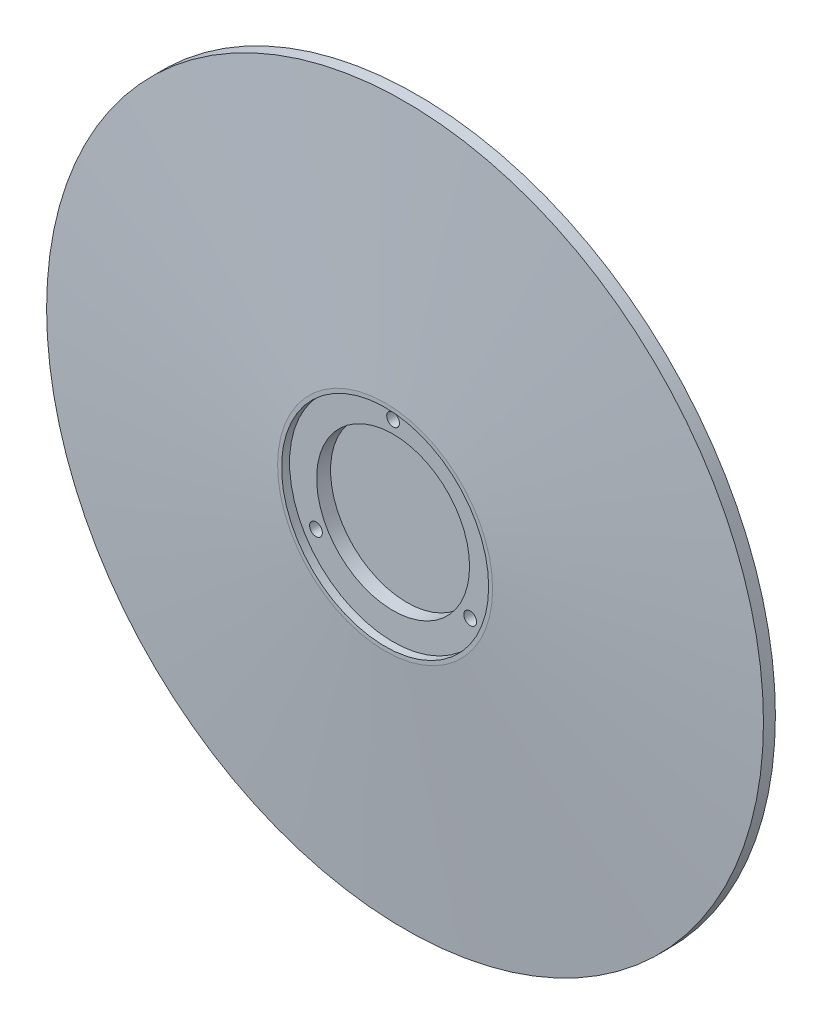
ISO-10303-21;
HEADER;
FILE_DESCRIPTION(('STEP AP214'),'2;1');
FILE_NAME('part.step','',(''),(''),'','','');
FILE_SCHEMA(('AUTOMOTIVE_DESIGN { 1 0 10303 214 1 1 1 1 }'));
ENDSEC;
DATA;
#1=APPLICATION_CONTEXT('core data for automotive mechanical design processes');
#2=APPLICATION_PROTOCOL_DEFINITION('international standard','automotive_design',2000,#1);
#3=PRODUCT_CONTEXT('',#1,'mechanical');
#4=PRODUCT('Part','Part','',(#3));
#5=PRODUCT_RELATED_PRODUCT_CATEGORY('part','',(#4));
#6=PRODUCT_DEFINITION_FORMATION('','',#4);
#7=PRODUCT_DEFINITION_CONTEXT('part definition',#1,'design');
#8=PRODUCT_DEFINITION('design','',#6,#7);
#9=PRODUCT_DEFINITION_SHAPE('','',#8);
#10=(LENGTH_UNIT() NAMED_UNIT(*) SI_UNIT(.MILLI.,.METRE.));
#11=(NAMED_UNIT(*) PLANE_ANGLE_UNIT() SI_UNIT($,.RADIAN.));
#12=(NAMED_UNIT(*) SI_UNIT($,.STERADIAN.) SOLID_ANGLE_UNIT());
#13=UNCERTAINTY_MEASURE_WITH_UNIT(LENGTH_MEASURE(1.E-05),#10,'distance_accuracy_value','');
#14=(GEOMETRIC_REPRESENTATION_CONTEXT(3) GLOBAL_UNCERTAINTY_ASSIGNED_CONTEXT((#13)) GLOBAL_UNIT_ASSIGNED_CONTEXT((#10,
#11,#12)) REPRESENTATION_CONTEXT('',''));
#15=CARTESIAN_POINT('',(0.,0.,0.));
#16=DIRECTION('',(0.,0.,1.));
#17=DIRECTION('',(1.,0.,0.));
#18=AXIS2_PLACEMENT_3D('',#15,#16,#17);
#19=CARTESIAN_POINT('',(0.,0.,0.));
#20=DIRECTION('',(0.,0.,-1.));
#21=DIRECTION('',(-1.,0.,0.));
#22=AXIS2_PLACEMENT_3D('',#19,#20,#21);
#23=PLANE('',#22);
#24=CARTESIAN_POINT('',(0.,0.,0.));
#25=DIRECTION('',(0.,0.,-1.));
#26=DIRECTION('',(-1.,0.,0.));
#27=AXIS2_PLACEMENT_3D('',#24,#25,#26);
#28=CIRCLE('',#27,90.);
#29=CARTESIAN_POINT('',(-90.,0.,0.));
#30=VERTEX_POINT('',#29);
#31=EDGE_CURVE('E10',#30,#30,#28,.T.);
#32=ORIENTED_EDGE('',*,*,#31,.T.);
#33=EDGE_LOOP('',(#32));
#34=FACE_BOUND('',#33,.T.);
#35=ADVANCED_FACE('F32',(#34),#23,.T.);
#36=CARTESIAN_POINT('',(0.,0.,-33.3508541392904));
#37=DIRECTION('',(0.,0.,-1.));
#38=DIRECTION('',(-1.,0.,0.));
#39=AXIS2_PLACEMENT_3D('',#36,#37,#38);
#40=CYLINDRICAL_SURFACE('',#39,90.);
#41=CARTESIAN_POINT('',(0.,0.,3.));
#42=DIRECTION('',(0.,0.,-1.));
#43=DIRECTION('',(-1.,0.,0.));
#44=AXIS2_PLACEMENT_3D('',#41,#42,#43);
#45=CIRCLE('',#44,90.);
#46=CARTESIAN_POINT('',(-90.,0.,3.));
#47=VERTEX_POINT('',#46);
#48=EDGE_CURVE('E38',#47,#47,#45,.T.);
#49=ORIENTED_EDGE('',*,*,#48,.T.);
#50=EDGE_LOOP('',(#49));
#51=FACE_BOUND('',#50,.T.);
#52=ORIENTED_EDGE('',*,*,#31,.F.);
#53=EDGE_LOOP('',(#52));
#54=FACE_BOUND('',#53,.T.);
#55=ADVANCED_FACE('F116',(#51,#54),#40,.T.);
#56=CARTESIAN_POINT('',(0.,0.,3.));
#57=DIRECTION('',(0.,0.,-1.));
#58=DIRECTION('',(-1.,0.,0.));
#59=AXIS2_PLACEMENT_3D('',#56,#57,#58);
#60=CONICAL_SURFACE('',#59,90.,1.49159725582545);
#61=CARTESIAN_POINT('',(0.,0.,8.));
#62=DIRECTION('',(0.,0.,-1.));
#63=DIRECTION('',(-1.,0.,0.));
#64=AXIS2_PLACEMENT_3D('',#61,#62,#63);
#65=CIRCLE('',#64,27.);
#66=CARTESIAN_POINT('',(-27.,0.,8.));
#67=VERTEX_POINT('',#66);
#68=EDGE_CURVE('E42',#67,#67,#65,.T.);
#69=CARTESIAN_POINT('',(-27.,0.,8.));
#70=CARTESIAN_POINT('',(-27.65625,0.,7.94791666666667));
#71=CARTESIAN_POINT('',(-28.3125,0.,7.89583333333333));
#72=CARTESIAN_POINT('',(-29.625,0.,7.79166666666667));
#73=CARTESIAN_POINT('',(-30.28125,0.,7.73958333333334));
#74=CARTESIAN_POINT('',(-31.59375,0.,7.63541666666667));
#75=CARTESIAN_POINT('',(-32.25,0.,7.58333333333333));
#76=CARTESIAN_POINT('',(-33.5625,0.,7.47916666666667));
#77=CARTESIAN_POINT('',(-34.21875,0.,7.42708333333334));
#78=CARTESIAN_POINT('',(-35.53125,0.,7.32291666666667));
#79=CARTESIAN_POINT('',(-36.1875,0.,7.27083333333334));
#80=CARTESIAN_POINT('',(-37.5,0.,7.16666666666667));
#81=CARTESIAN_POINT('',(-38.15625,0.,7.11458333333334));
#82=CARTESIAN_POINT('',(-39.46875,0.,7.01041666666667));
#83=CARTESIAN_POINT('',(-40.125,0.,6.95833333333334));
#84=CARTESIAN_POINT('',(-41.4375,0.,6.85416666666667));
#85=CARTESIAN_POINT('',(-42.09375,0.,6.80208333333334));
#86=CARTESIAN_POINT('',(-43.40625,0.,6.69791666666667));
#87=CARTESIAN_POINT('',(-44.0625,0.,6.64583333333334));
#88=CARTESIAN_POINT('',(-45.375,0.,6.54166666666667));
#89=CARTESIAN_POINT('',(-46.03125,0.,6.48958333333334));
#90=CARTESIAN_POINT('',(-47.34375,0.,6.38541666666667));
#91=CARTESIAN_POINT('',(-48.,0.,6.33333333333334));
#92=CARTESIAN_POINT('',(-49.3125,0.,6.22916666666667));
#93=CARTESIAN_POINT('',(-49.96875,0.,6.17708333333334));
#94=CARTESIAN_POINT('',(-51.28125,0.,6.07291666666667));
#95=CARTESIAN_POINT('',(-51.9375,0.,6.02083333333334));
#96=CARTESIAN_POINT('',(-53.25,0.,5.91666666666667));
#97=CARTESIAN_POINT('',(-53.90625,0.,5.86458333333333));
#98=CARTESIAN_POINT('',(-55.21875,0.,5.76041666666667));
#99=CARTESIAN_POINT('',(-55.875,0.,5.70833333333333));
#100=CARTESIAN_POINT('',(-57.1875,0.,5.60416666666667));
#101=CARTESIAN_POINT('',(-57.84375,0.,5.55208333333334));
#102=CARTESIAN_POINT('',(-59.15625,0.,5.44791666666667));
#103=CARTESIAN_POINT('',(-59.8125,0.,5.39583333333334));
#104=CARTESIAN_POINT('',(-61.125,0.,5.29166666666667));
#105=CARTESIAN_POINT('',(-61.78125,0.,5.23958333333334));
#106=CARTESIAN_POINT('',(-63.09375,0.,5.13541666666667));
#107=CARTESIAN_POINT('',(-63.75,0.,5.08333333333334));
#108=CARTESIAN_POINT('',(-65.0625,0.,4.97916666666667));
#109=CARTESIAN_POINT('',(-65.71875,0.,4.92708333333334));
#110=CARTESIAN_POINT('',(-67.03125,0.,4.82291666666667));
#111=CARTESIAN_POINT('',(-67.6875,0.,4.77083333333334));
#112=CARTESIAN_POINT('',(-69.,0.,4.66666666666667));
#113=CARTESIAN_POINT('',(-69.65625,0.,4.61458333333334));
#114=CARTESIAN_POINT('',(-70.96875,0.,4.51041666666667));
#115=CARTESIAN_POINT('',(-71.625,0.,4.45833333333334));
#116=CARTESIAN_POINT('',(-72.9375,0.,4.35416666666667));
#117=CARTESIAN_POINT('',(-73.59375,0.,4.30208333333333));
#118=CARTESIAN_POINT('',(-74.90625,0.,4.19791666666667));
#119=CARTESIAN_POINT('',(-75.5625,0.,4.14583333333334));
#120=CARTESIAN_POINT('',(-76.875,0.,4.04166666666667));
#121=CARTESIAN_POINT('',(-77.53125,0.,3.98958333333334));
#122=CARTESIAN_POINT('',(-78.84375,0.,3.88541666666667));
#123=CARTESIAN_POINT('',(-79.5,0.,3.83333333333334));
#124=CARTESIAN_POINT('',(-80.8125,0.,3.72916666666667));
#125=CARTESIAN_POINT('',(-81.46875,0.,3.67708333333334));
#126=CARTESIAN_POINT('',(-82.78125,0.,3.57291666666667));
#127=CARTESIAN_POINT('',(-83.4375,0.,3.52083333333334));
#128=CARTESIAN_POINT('',(-84.75,0.,3.41666666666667));
#129=CARTESIAN_POINT('',(-85.40625,0.,3.36458333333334));
#130=CARTESIAN_POINT('',(-86.71875,0.,3.26041666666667));
#131=CARTESIAN_POINT('',(-87.375,0.,3.20833333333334));
#132=CARTESIAN_POINT('',(-88.6875,0.,3.10416666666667));
#133=CARTESIAN_POINT('',(-89.34375,0.,3.05208333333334));
#134=CARTESIAN_POINT('',(-90.,0.,3.));
#135=B_SPLINE_CURVE_WITH_KNOTS('',3,(#69,#70,#71,#72,#73,#74,#75,#76,#77,#78,#79,#80,#81,#82,
#83,#84,#85,#86,#87,#88,#89,#90,#91,#92,#93,#94,#95,#96,#97,#98,#99,#100,#101,#102,#103,#104,
#105,#106,#107,#108,#109,#110,#111,#112,#113,#114,#115,#116,#117,#118,#119,#120,#121,#122,#123,
#124,#125,#126,#127,#128,#129,#130,#131,#132,#133,#134),.UNSPECIFIED.,.F.,.F.,(4,2,2,2,2,2,2,2,
2,2,2,2,2,2,2,2,2,2,2,2,2,2,2,2,2,2,2,2,2,2,2,2,4),(0.,1.97494066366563,3.94988132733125,
5.92482199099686,7.89976265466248,9.87470331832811,11.8496439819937,13.8245846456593,
15.799525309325,17.7744659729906,19.7494066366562,21.7243473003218,23.6992879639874,
25.6742286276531,27.6491692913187,29.6241099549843,31.5990506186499,33.5739912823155,
35.5489319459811,37.5238726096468,39.4988132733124,41.473753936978,43.4486946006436,
45.4236352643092,47.3985759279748,49.3735165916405,51.3484572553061,53.3233979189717,
55.2983385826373,57.273279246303,59.2482199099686,61.2231605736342,63.1981012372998),.UNSPECIFIED.);
#136=EDGE_CURVE('BSEAM110',#67,#47,#135,.T.);
#137=ORIENTED_EDGE('',*,*,#68,.T.);
#138=ORIENTED_EDGE('',*,*,#48,.F.);
#139=ORIENTED_EDGE('',*,*,#136,.T.);
#140=ORIENTED_EDGE('',*,*,#136,.F.);
#141=EDGE_LOOP('',(#137,#139,#138,#140));
#142=FACE_BOUND('',#141,.T.);
#143=ADVANCED_FACE('F110',(#142),#60,.T.);
#144=CARTESIAN_POINT('',(0.,27.,8.));
#145=DIRECTION('',(0.,0.,1.));
#146=DIRECTION('',(1.,0.,0.));
#147=AXIS2_PLACEMENT_3D('',#144,#145,#146);
#148=PLANE('',#147);
#149=CARTESIAN_POINT('',(0.,0.,8.));
#150=DIRECTION('',(0.,0.,1.));
#151=DIRECTION('',(1.,0.,0.));
#152=AXIS2_PLACEMENT_3D('',#149,#150,#151);
#153=CIRCLE('',#152,26.);
#154=CARTESIAN_POINT('',(26.,0.,8.));
#155=VERTEX_POINT('',#154);
#156=EDGE_CURVE('E49',#155,#155,#153,.T.);
#157=ORIENTED_EDGE('',*,*,#156,.F.);
#158=EDGE_LOOP('',(#157));
#159=FACE_BOUND('',#158,.T.);
#160=ORIENTED_EDGE('',*,*,#68,.F.);
#161=EDGE_LOOP('',(#160));
#162=FACE_BOUND('',#161,.T.);
#163=ADVANCED_FACE('F104',(#159,#162),#148,.T.);
#164=CARTESIAN_POINT('',(0.,0.,6.));
#165=DIRECTION('',(0.,0.,1.));
#166=DIRECTION('',(1.,0.,0.));
#167=AXIS2_PLACEMENT_3D('',#164,#165,#166);
#168=CYLINDRICAL_SURFACE('',#167,26.);
#169=CARTESIAN_POINT('',(0.,0.,6.));
#170=DIRECTION('',(0.,0.,1.));
#171=DIRECTION('',(1.,0.,0.));
#172=AXIS2_PLACEMENT_3D('',#169,#170,#171);
#173=CIRCLE('',#172,26.);
#174=CARTESIAN_POINT('',(26.,0.,6.));
#175=VERTEX_POINT('',#174);
#176=EDGE_CURVE('E46',#175,#175,#173,.T.);
#177=ORIENTED_EDGE('',*,*,#176,.F.);
#178=EDGE_LOOP('',(#177));
#179=FACE_BOUND('',#178,.T.);
#180=ORIENTED_EDGE('',*,*,#156,.T.);
#181=EDGE_LOOP('',(#180));
#182=FACE_BOUND('',#181,.T.);
#183=ADVANCED_FACE('F92',(#179,#182),#168,.F.);
#184=CARTESIAN_POINT('',(0.,0.,6.));
#185=DIRECTION('',(0.,0.,1.));
#186=DIRECTION('',(1.,0.,0.));
#187=AXIS2_PLACEMENT_3D('',#184,#185,#186);
#188=PLANE('',#187);
#189=CARTESIAN_POINT('',(0.,22.35,6.));
#190=DIRECTION('',(0.,0.,1.));
#191=DIRECTION('',(1.,0.,0.));
#192=AXIS2_PLACEMENT_3D('',#189,#190,#191);
#193=CIRCLE('',#192,1.6);
#194=CARTESIAN_POINT('',(1.6,22.35,6.));
#195=VERTEX_POINT('',#194);
#196=EDGE_CURVE('E73',#195,#195,#193,.T.);
#197=ORIENTED_EDGE('',*,*,#196,.F.);
#198=EDGE_LOOP('',(#197));
#199=FACE_BOUND('',#198,.T.);
#200=CARTESIAN_POINT('',(19.3556677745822,-11.175,6.));
#201=DIRECTION('',(0.,0.,1.));
#202=DIRECTION('',(1.,0.,0.));
#203=AXIS2_PLACEMENT_3D('',#200,#201,#202);
#204=CIRCLE('',#203,1.60000000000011);
#205=CARTESIAN_POINT('',(20.9556677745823,-11.175,6.));
#206=VERTEX_POINT('',#205);
#207=EDGE_CURVE('E67',#206,#206,#204,.T.);
#208=ORIENTED_EDGE('',*,*,#207,.F.);
#209=EDGE_LOOP('',(#208));
#210=FACE_BOUND('',#209,.T.);
#211=CARTESIAN_POINT('',(-19.3556677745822,-11.175,6.));
#212=DIRECTION('',(0.,0.,1.));
#213=DIRECTION('',(1.,0.,0.));
#214=AXIS2_PLACEMENT_3D('',#211,#212,#213);
#215=CIRCLE('',#214,1.6);
#216=CARTESIAN_POINT('',(-17.7556677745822,-11.175,6.));
#217=VERTEX_POINT('',#216);
#218=EDGE_CURVE('E61',#217,#217,#215,.T.);
#219=ORIENTED_EDGE('',*,*,#218,.F.);
#220=EDGE_LOOP('',(#219));
#221=FACE_BOUND('',#220,.T.);
#222=CARTESIAN_POINT('',(0.,0.,6.));
#223=DIRECTION('',(0.,0.,1.));
#224=DIRECTION('',(1.,0.,0.));
#225=AXIS2_PLACEMENT_3D('',#222,#223,#224);
#226=CIRCLE('',#225,19.2);
#227=CARTESIAN_POINT('',(19.2,0.,6.));
#228=VERTEX_POINT('',#227);
#229=EDGE_CURVE('E55',#228,#228,#226,.T.);
#230=ORIENTED_EDGE('',*,*,#229,.F.);
#231=EDGE_LOOP('',(#230));
#232=FACE_BOUND('',#231,.T.);
#233=ORIENTED_EDGE('',*,*,#176,.T.);
#234=EDGE_LOOP('',(#233));
#235=FACE_BOUND('',#234,.T.);
#236=ADVANCED_FACE('F88',(#199,#210,#221,#232,#235),#188,.T.);
#237=CARTESIAN_POINT('',(0.,0.,2.5));
#238=DIRECTION('',(0.,0.,1.));
#239=DIRECTION('',(1.,0.,0.));
#240=AXIS2_PLACEMENT_3D('',#237,#238,#239);
#241=CYLINDRICAL_SURFACE('',#240,19.2);
#242=CARTESIAN_POINT('',(0.,0.,2.5));
#243=DIRECTION('',(0.,0.,1.));
#244=DIRECTION('',(1.,0.,0.));
#245=AXIS2_PLACEMENT_3D('',#242,#243,#244);
#246=CIRCLE('',#245,19.2);
#247=CARTESIAN_POINT('',(19.2,0.,2.5));
#248=VERTEX_POINT('',#247);
#249=EDGE_CURVE('E52',#248,#248,#246,.T.);
#250=ORIENTED_EDGE('',*,*,#249,.F.);
#251=EDGE_LOOP('',(#250));
#252=FACE_BOUND('',#251,.T.);
#253=ORIENTED_EDGE('',*,*,#229,.T.);
#254=EDGE_LOOP('',(#253));
#255=FACE_BOUND('',#254,.T.);
#256=ADVANCED_FACE('F91',(#252,#255),#241,.F.);
#257=CARTESIAN_POINT('',(0.,0.,2.5));
#258=DIRECTION('',(0.,0.,1.));
#259=DIRECTION('',(1.,0.,0.));
#260=AXIS2_PLACEMENT_3D('',#257,#258,#259);
#261=PLANE('',#260);
#262=ORIENTED_EDGE('',*,*,#249,.T.);
#263=EDGE_LOOP('',(#262));
#264=FACE_BOUND('',#263,.T.);
#265=ADVANCED_FACE('F152',(#264),#261,.T.);
#266=CARTESIAN_POINT('',(-19.3556677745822,-11.175,2.));
#267=DIRECTION('',(0.,0.,1.));
#268=DIRECTION('',(1.,0.,0.));
#269=AXIS2_PLACEMENT_3D('',#266,#267,#268);
#270=CYLINDRICAL_SURFACE('',#269,1.6);
#271=CARTESIAN_POINT('',(-19.3556677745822,-11.175,2.));
#272=DIRECTION('',(0.,0.,1.));
#273=DIRECTION('',(1.,0.,0.));
#274=AXIS2_PLACEMENT_3D('',#271,#272,#273);
#275=CIRCLE('',#274,1.6);
#276=CARTESIAN_POINT('',(-17.7556677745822,-11.175,2.));
#277=VERTEX_POINT('',#276);
#278=EDGE_CURVE('E64',#277,#277,#275,.T.);
#279=ORIENTED_EDGE('',*,*,#278,.F.);
#280=EDGE_LOOP('',(#279));
#281=FACE_BOUND('',#280,.T.);
#282=ORIENTED_EDGE('',*,*,#218,.T.);
#283=EDGE_LOOP('',(#282));
#284=FACE_BOUND('',#283,.T.);
#285=ADVANCED_FACE('F162',(#281,#284),#270,.F.);
#286=CARTESIAN_POINT('',(-19.3556677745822,-11.175,2.));
#287=DIRECTION('',(0.,0.,1.));
#288=DIRECTION('',(1.,0.,0.));
#289=AXIS2_PLACEMENT_3D('',#286,#287,#288);
#290=PLANE('',#289);
#291=ORIENTED_EDGE('',*,*,#278,.T.);
#292=EDGE_LOOP('',(#291));
#293=FACE_BOUND('',#292,.T.);
#294=ADVANCED_FACE('F177',(#293),#290,.T.);
#295=CARTESIAN_POINT('',(19.3556677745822,-11.175,2.));
#296=DIRECTION('',(0.,0.,1.));
#297=DIRECTION('',(1.,0.,0.));
#298=AXIS2_PLACEMENT_3D('',#295,#296,#297);
#299=CYLINDRICAL_SURFACE('',#298,1.60000000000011);
#300=CARTESIAN_POINT('',(19.3556677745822,-11.175,2.));
#301=DIRECTION('',(0.,0.,1.));
#302=DIRECTION('',(1.,0.,0.));
#303=AXIS2_PLACEMENT_3D('',#300,#301,#302);
#304=CIRCLE('',#303,1.60000000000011);
#305=CARTESIAN_POINT('',(20.9556677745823,-11.175,2.));
#306=VERTEX_POINT('',#305);
#307=EDGE_CURVE('E70',#306,#306,#304,.T.);
#308=ORIENTED_EDGE('',*,*,#307,.F.);
#309=EDGE_LOOP('',(#308));
#310=FACE_BOUND('',#309,.T.);
#311=ORIENTED_EDGE('',*,*,#207,.T.);
#312=EDGE_LOOP('',(#311));
#313=FACE_BOUND('',#312,.T.);
#314=ADVANCED_FACE('F187',(#310,#313),#299,.F.);
#315=CARTESIAN_POINT('',(19.3556677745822,-11.175,2.));
#316=DIRECTION('',(0.,0.,1.));
#317=DIRECTION('',(1.,0.,0.));
#318=AXIS2_PLACEMENT_3D('',#315,#316,#317);
#319=PLANE('',#318);
#320=ORIENTED_EDGE('',*,*,#307,.T.);
#321=EDGE_LOOP('',(#320));
#322=FACE_BOUND('',#321,.T.);
#323=ADVANCED_FACE('F84',(#322),#319,.T.);
#324=CARTESIAN_POINT('',(0.,22.35,2.));
#325=DIRECTION('',(0.,0.,1.));
#326=DIRECTION('',(1.,0.,0.));
#327=AXIS2_PLACEMENT_3D('',#324,#325,#326);
#328=CYLINDRICAL_SURFACE('',#327,1.6);
#329=CARTESIAN_POINT('',(0.,22.35,2.));
#330=DIRECTION('',(0.,0.,1.));
#331=DIRECTION('',(1.,0.,0.));
#332=AXIS2_PLACEMENT_3D('',#329,#330,#331);
#333=CIRCLE('',#332,1.6);
#334=CARTESIAN_POINT('',(1.6,22.35,2.));
#335=VERTEX_POINT('',#334);
#336=EDGE_CURVE('E58',#335,#335,#333,.T.);
#337=ORIENTED_EDGE('',*,*,#336,.F.);
#338=EDGE_LOOP('',(#337));
#339=FACE_BOUND('',#338,.T.);
#340=ORIENTED_EDGE('',*,*,#196,.T.);
#341=EDGE_LOOP('',(#340));
#342=FACE_BOUND('',#341,.T.);
#343=ADVANCED_FACE('F81',(#339,#342),#328,.F.);
#344=CARTESIAN_POINT('',(0.,22.35,2.));
#345=DIRECTION('',(0.,0.,1.));
#346=DIRECTION('',(1.,0.,0.));
#347=AXIS2_PLACEMENT_3D('',#344,#345,#346);
#348=PLANE('',#347);
#349=ORIENTED_EDGE('',*,*,#336,.T.);
#350=EDGE_LOOP('',(#349));
#351=FACE_BOUND('',#350,.T.);
#352=ADVANCED_FACE('F79',(#351),#348,.T.);
#353=CLOSED_SHELL('',(#35,#55,#143,#163,#183,#236,#256,#265,#285,#294,#314,#323,#343,#352));
#354=MANIFOLD_SOLID_BREP('B2',#353);
#355=ADVANCED_BREP_SHAPE_REPRESENTATION('',(#18,#354),#14);
#356=SHAPE_DEFINITION_REPRESENTATION(#9,#355);
ENDSEC;
END-ISO-10303-21;
